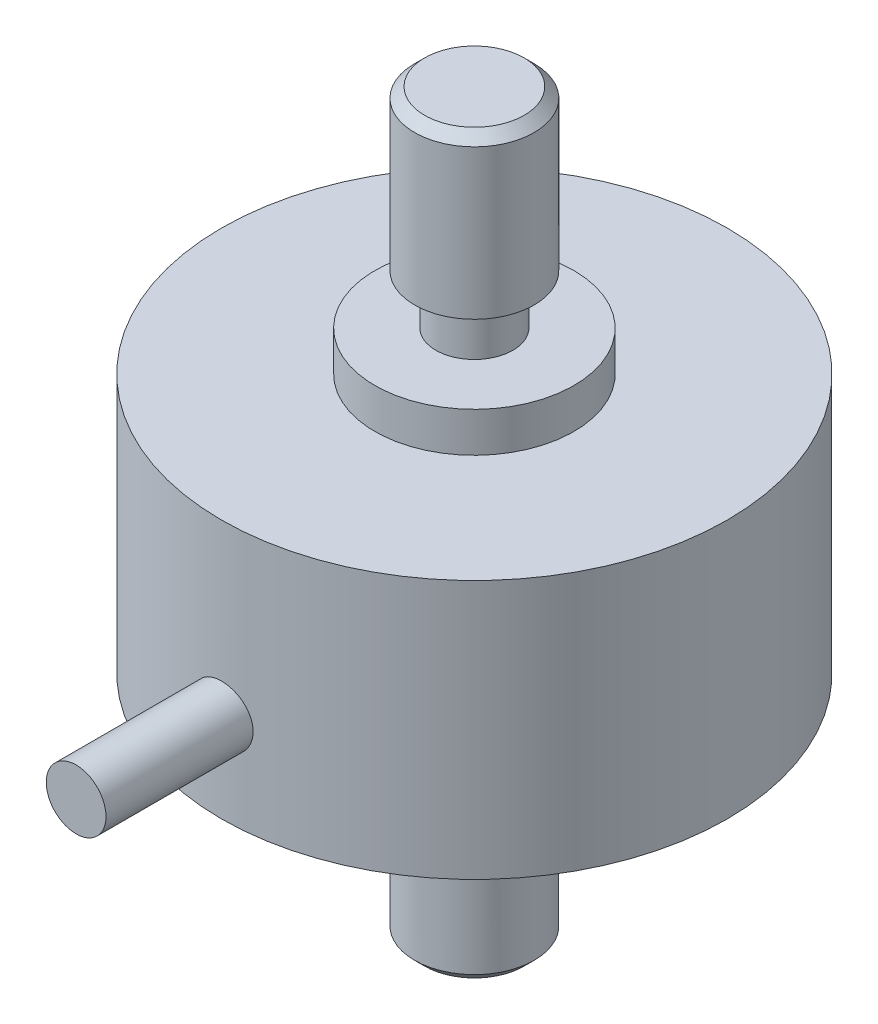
from build123d import *

# Parameters (mm, degrees)
SKETCH2_R           = 1.5
BOSS_EXTRUDE1_DEPTH = 20
CHAMFER1_SIZE       = 0.5


with BuildPart() as part:
    # Sketch1 → Revolve1 (revolve)
    with BuildSketch(Plane.XY, mode=Mode.PRIVATE) as revolve1_sk:
        Polygon((0, 37), (-3, 37), (-3, 29), (-1.93637753, 29), (-1.93637753, 26.5), (-5, 26.5), (-5, 24.5), (-12.7, 24.5), (-12.7, 11.5), (-3.3, 11.5), (-3.3, 10.5), (-2.309270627, 10.5), (-2.309270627, 8), (-3, 8), (-3, 0), (0, 0), align=None)
    revolve(revolve1_sk.sketch.rotate(Axis((0, 0, 0), (0, 1, 0)), 270), axis=Axis((0, 0, 0), (0, 1, 0)))

    # Sketch2 → Boss-Extrude1 (add)
    with BuildSketch(Plane.XY):
        with Locations(Location((0, 16, 0), (0, 0, 180))):
            Circle(SKETCH2_R)
    extrude(amount=BOSS_EXTRUDE1_DEPTH)

    # Chamfer1
    chamfer1_edges = [part.edges().sort_by_distance(p)[0] for p in [
        (0, 0, 3),
        (0, 37, 3),
    ]]
    chamfer(chamfer1_edges, length=CHAMFER1_SIZE)


solid = part.part
